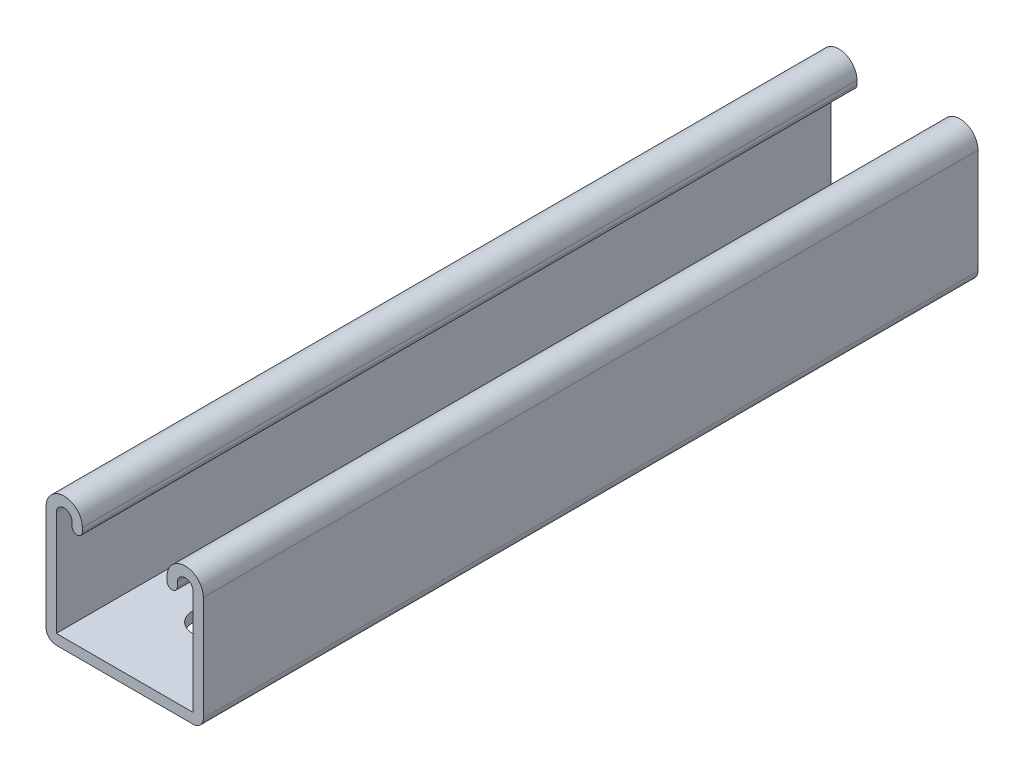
from build123d import *

# Parameters (mm, degrees)
BASE_EXTRUDE_DEPTH = 203.2
SLOT_DEPTH         = 231.87446075
LPATTERN1_COUNT    = 2
LPATTERN1_PITCH    = 101.6


with BuildPart() as part:
    # Sketch1 → Base-Extrude (new body)
    with BuildSketch(Plane.XY):
        with BuildLine():
            Line((-20.6375, 15.1511), (-20.6375, -12.319))
            ThreePointArc((-20.6375, -12.319), (-19.848914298, -14.222814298), (-17.9451, -15.0114))
            Line((-17.9451, -15.0114), (17.9451, -15.0114))
            ThreePointArc((17.9451, -15.0114), (19.848914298, -14.222814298), (20.6375, -12.319))
            Line((20.6375, -12.319), (20.6375, 15.1511))
            ThreePointArc((20.6375, 15.1511), (15.875, 19.9136), (11.1125, 15.1511))
            Line((11.1125, 15.1511), (11.1125, 14.11605))
            ThreePointArc((11.1125, 14.11605), (12.4587, 12.76985), (13.8049, 14.11605))
            Line((13.8049, 14.11605), (13.8049, 15.1511))
            ThreePointArc((13.8049, 15.1511), (15.875, 17.2212), (17.9451, 15.1511))
            Line((17.9451, 15.1511), (17.9451, -12.319))
            Line((17.9451, -12.319), (-17.9451, -12.319))
            Line((-17.9451, -12.319), (-17.9451, 15.1511))
            ThreePointArc((-17.9451, 15.1511), (-15.875, 17.2212), (-13.8049, 15.1511))
            Line((-13.8049, 15.1511), (-13.8049, 14.11605))
            ThreePointArc((-13.8049, 14.11605), (-12.4587, 12.76985), (-11.1125, 14.11605))
            Line((-11.1125, 14.11605), (-11.1125, 15.1511))
            ThreePointArc((-11.1125, 15.1511), (-15.875, 19.9136), (-20.6375, 15.1511))
        make_face()
    extrude(amount=BASE_EXTRUDE_DEPTH)

    # Sketch2 → Slot (cut, through all)
    with BuildSketch(Plane(origin=(0.747608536, -15.0114, -24.013419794), x_dir=(1, 0, 0), z_dir=(0, -1, 0))):
        with BuildLine():
            Line((4.411766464, 102.594669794), (4.411766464, 36.713419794))
            ThreePointArc((4.411766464, 36.713419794), (-0.747608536, 31.554044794), (-5.906983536, 36.713419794))
            Line((-5.906983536, 36.713419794), (-5.906983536, 102.594669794))
            ThreePointArc((-5.906983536, 102.594669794), (-0.747608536, 107.754044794), (4.411766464, 102.594669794))
        make_face()
    slot = extrude(amount=-SLOT_DEPTH, mode=Mode.SUBTRACT)

    # LPattern1: Slot ×2
    with Locations(*[(0, 0, i * LPATTERN1_PITCH) for i in range(1, LPATTERN1_COUNT)]):
        add(slot, mode=Mode.SUBTRACT)


solid = part.part
